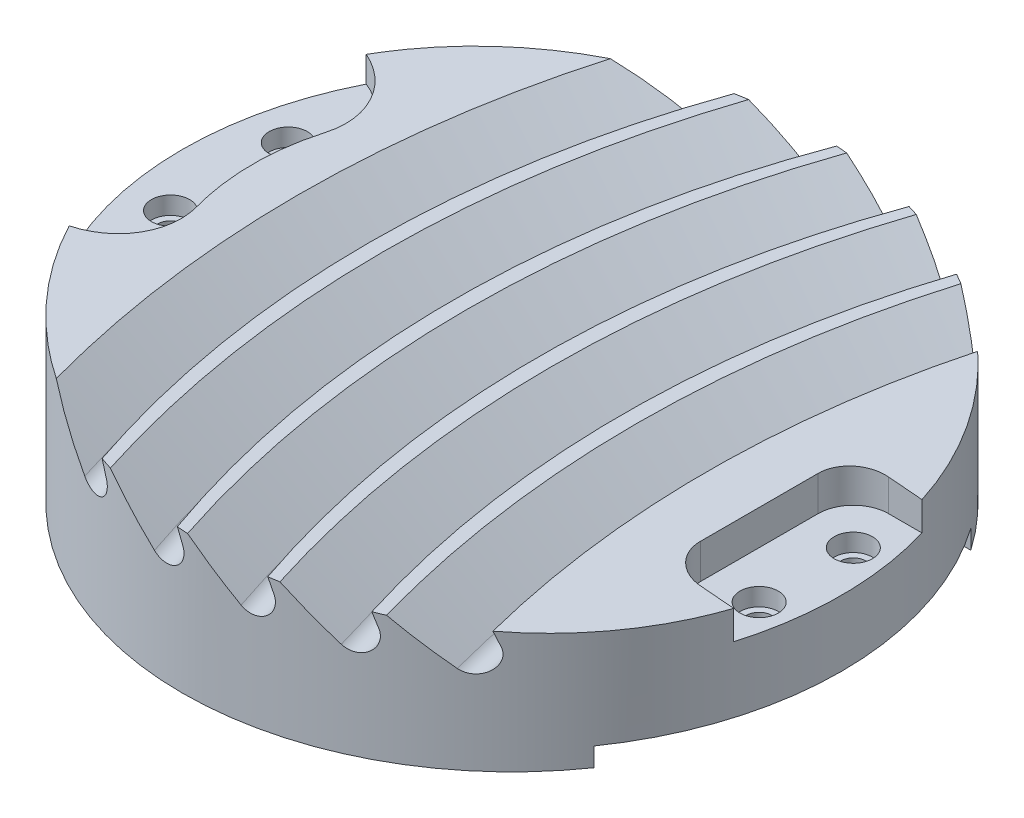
from build123d import *

# Parameters (mm, degrees)
SKETCH1_R                                        = 88.9
BOSS_EXTRUDE1_DEPTH                              = 50.8
CUT_EXTRUDE1_DEPTH                               = 136.598893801
CUT_EXTRUDE1_DEPTH_BACK                          = 136.598893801
LPATTERN1_COUNT                                  = 5
LPATTERN1_PITCH                                  = 22.86
CUT_EXTRUDE2_START                               = 38.1
CUT_EXTRUDE2_DEPTH                               = 50.8
CUT_EXTRUDE3_START                               = -22.86
SKETCH9_W                                        = 35.539184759
SKETCH9_H                                        = 50.8
CUT_EXTRUDE3_DEPTH                               = 111.689039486
FILLET1_R                                        = 9.525
CBORE_FOR_1_4_SOCKET_SHOULDER_SCREW1_D           = 6.7564
CBORE_FOR_1_4_SOCKET_SHOULDER_SCREW1_CBORE_D     = 10.31748
CBORE_FOR_1_4_SOCKET_SHOULDER_SCREW1_CBORE_DEPTH = 4.7752
CBORE_FOR_1_4_SOCKET_SHOULDER_SCREW2_D           = 6.7564
CBORE_FOR_1_4_SOCKET_SHOULDER_SCREW2_CBORE_D     = 10.31748
CBORE_FOR_1_4_SOCKET_SHOULDER_SCREW2_CBORE_DEPTH = 4.7752
CUT_EXTRUDE4_DEPTH                               = 134.549039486
CUT_EXTRUDE4_DEPTH_BACK                          = 134.549039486
SKETCH14_W                                       = 101.6
SKETCH14_H                                       = 5.08


with BuildPart() as part:
    # Sketch1 → Boss-Extrude1 (new body)
    with BuildSketch(Plane(origin=(0, 0, 0), x_dir=(1, 0, 0), z_dir=(0, 1, 0))):
        with Locations(Location((0, 0, 0), (0, 0, 270))):
            Circle(SKETCH1_R)
    extrude(amount=BOSS_EXTRUDE1_DEPTH)

    # Sketch2 → Cut-Extrude1 (cut, two sides: drawn at the far end of the back side and taken through both)
    with BuildSketch(Plane.XY.offset(-CUT_EXTRUDE1_DEPTH_BACK)):
        Polygon((-524.13440382, 83.955818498), (-108.871248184, 47.625), (108.871248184, 28.575), (524.13440382, -7.755818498), (596.796040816, 822.770492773), (-451.472766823, 914.48212977), align=None)
    extrude(amount=CUT_EXTRUDE1_DEPTH + CUT_EXTRUDE1_DEPTH_BACK, mode=Mode.SUBTRACT)

    # Cut-Sweep2: sweep along a path in Sketch4
    with BuildLine(Plane(origin=(3.307997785, 37.810587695, 0), x_dir=(0.9961946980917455, -0.0871557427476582, 0), z_dir=(0.0871557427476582, 0.9961946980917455, 0))) as cut_sweep2_path:
        ThreePointArc((82.55, -132.017452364), (49.393278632, 0), (82.55, 132.017452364))
    # Sketch5 → Cut-Sweep2 (sweep, cut)
    with BuildSketch(Plane(origin=(85.543870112, 30.615881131, 132.017452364), x_dir=(-0.8822864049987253, -0.01894613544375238, 0.4703315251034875), z_dir=(-0.470705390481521, 0.04118138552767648, -0.8813288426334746))):
        with BuildLine():
            Line((19.05, 1.832850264), (6.199869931, -8.949689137))
            ThreePointArc((6.199869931, -8.949689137), (0.406936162, -9.202614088), (-1.336692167, -3.672531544))
            Line((-1.336692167, -3.672531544), (0, 0))
            Line((0, 0), (19.05, 1.832850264))
        make_face()
    cut_sweep2 = sweep(path=cut_sweep2_path.line, mode=Mode.SUBTRACT)

    # LPattern1: Cut-Sweep2 ×5
    with Locations(*[Vector(-0.9961946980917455, 0.0871557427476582, 0) * (i * LPATTERN1_PITCH) for i in range(1, LPATTERN1_COUNT)]):
        add(cut_sweep2, mode=Mode.SUBTRACT)

    # Sketch8 → Cut-Extrude2 (cut)
    with BuildSketch(Plane(origin=(0, 0, 0), x_dir=(1, 0, 0), z_dir=(0, 1, 0)).offset(CUT_EXTRUDE2_START)):
        with BuildLine():
            ThreePointArc((-104.522138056, 26.9875), (-107.95, 0), (-104.522138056, -26.9875))
            ThreePointArc((-104.522138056, -26.9875), (-81.314554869, -40.670083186), (-67.631971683, -17.4625))
            ThreePointArc((-67.631971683, -17.4625), (-69.85, 0), (-67.631971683, 17.4625))
            ThreePointArc((-67.631971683, 17.4625), (-81.314554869, 40.670083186), (-104.522138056, 26.9875))
        make_face()
    extrude(amount=CUT_EXTRUDE2_DEPTH, mode=Mode.SUBTRACT)

    # Sketch9 → Cut-Extrude3 (cut, through all)
    with BuildSketch(Plane.XZ.offset(CUT_EXTRUDE3_START)):
        with Locations((84.444592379, 0)):
            Rectangle(SKETCH9_W, SKETCH9_H)
    extrude(amount=-CUT_EXTRUDE3_DEPTH, mode=Mode.SUBTRACT)

    # Fillet1
    fillet1_edges = [part.edges().sort_by_distance(p)[0] for p in [
        (66.675, 27.56334668, 25.4),
        (66.675, 27.56334668, -25.4),
    ]]
    fillet(fillet1_edges, radius=FILLET1_R)

    # CBORE for 1_4 Socket Shoulder Screw1 (through all)
    with Locations(Plane(origin=(0, 38.1, 0), x_dir=(1, 0, 0), z_dir=(0, 1, 0))):
        with Locations((-76.2, 15.875), (-76.2, -15.875)):
            CounterBoreHole(CBORE_FOR_1_4_SOCKET_SHOULDER_SCREW1_D / 2, CBORE_FOR_1_4_SOCKET_SHOULDER_SCREW1_CBORE_D / 2, CBORE_FOR_1_4_SOCKET_SHOULDER_SCREW1_CBORE_DEPTH)

    # CBORE for 1_4 Socket Shoulder Screw2 (through all)
    with Locations(Plane(origin=(0, 22.86, 0), x_dir=(1, 0, 0), z_dir=(0, 1, 0))):
        with Locations((79.375, 12.7), (79.375, -12.7)):
            CounterBoreHole(CBORE_FOR_1_4_SOCKET_SHOULDER_SCREW2_D / 2, CBORE_FOR_1_4_SOCKET_SHOULDER_SCREW2_CBORE_D / 2, CBORE_FOR_1_4_SOCKET_SHOULDER_SCREW2_CBORE_DEPTH)

    # Sketch14 → Cut-Extrude4 (cut, two sides: drawn at the far end of the back side and taken through both)
    with BuildSketch(Plane(origin=(0, 0, 0), x_dir=(0, 0, -1), z_dir=(1, 0, 0)).offset(-CUT_EXTRUDE4_DEPTH_BACK)):
        with Locations((0, 2.54)):
            Rectangle(SKETCH14_W, SKETCH14_H)
    extrude(amount=CUT_EXTRUDE4_DEPTH + CUT_EXTRUDE4_DEPTH_BACK, mode=Mode.SUBTRACT)


solid = part.part
